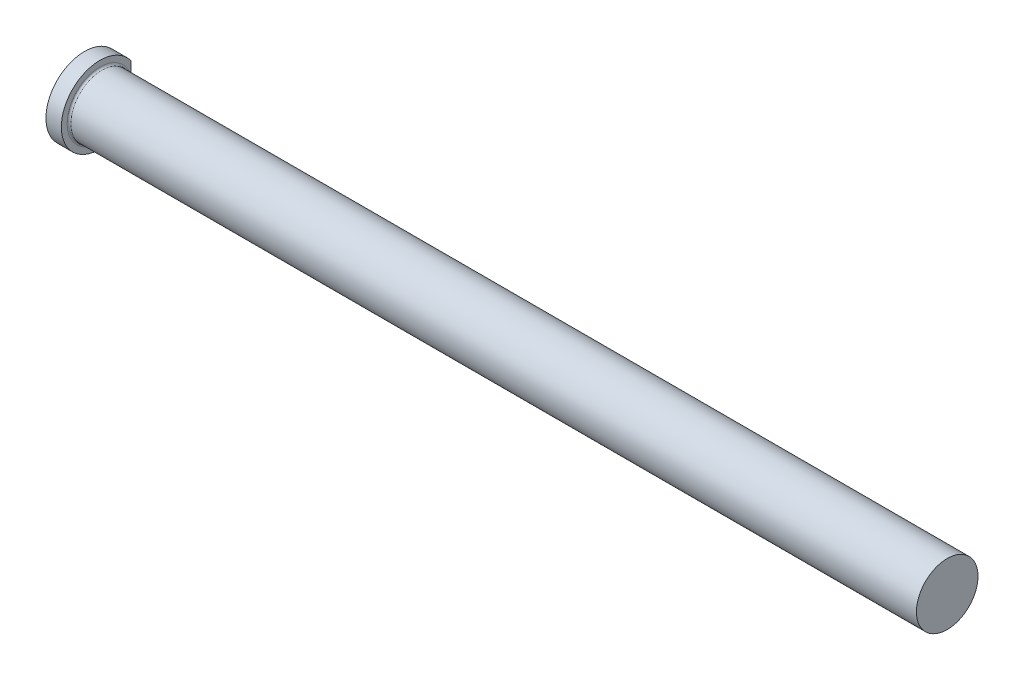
from build123d import *


with BuildPart() as part:
    # Sketch1 → PIN (revolve)
    with BuildSketch(Plane.XY, mode=Mode.PRIVATE) as pin_sk:
        with BuildLine():
            Line((0, 0), (0, 15.875))
            Line((0, 15.875), (6.35, 15.875))
            Line((6.35, 15.875), (6.35, 13.48105))
            ThreePointArc((6.35, 13.48105), (6.58062412, 12.92427412), (7.1374, 12.69365))
            Line((7.1374, 12.69365), (355.6, 12.69365))
            Line((355.6, 12.69365), (355.6, 0))
            Line((355.6, 0), (0, 0))
        make_face()
    revolve(pin_sk.sketch.rotate(Axis((355.6, 0, 0), (-1, 0, 0)), 180), axis=Axis((355.6, 0, 0), (-1, 0, 0)))

    # SurfaceCut1
    split(bisect_by=Plane(origin=(0, 0, -12.87145), x_dir=(-1, 0, 0), z_dir=(0, 0, -1)), keep=Keep.BOTTOM)


solid = part.part
